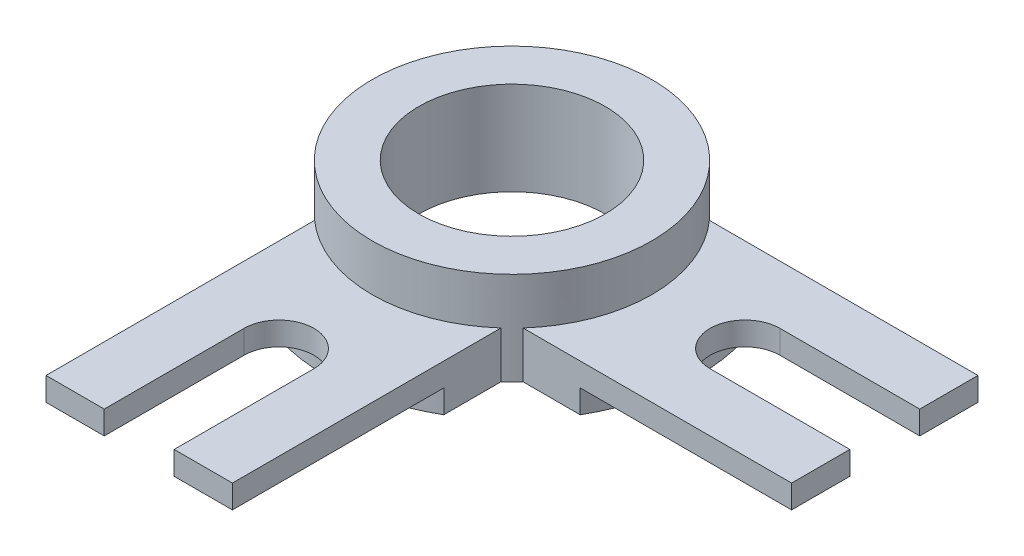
from build123d import *

# Parameters (mm, degrees)
SKETCH_1_R               = 30
EXTRUDE_1_DEPTH          = 20
SKETCH_2_W               = 80
SKETCH_2_H               = 40
EXTRUDE_2_DEPTH          = 10
CUT_EXTRUDE_1_DEPTH      = 87.02325267
SKETCH_4_OUTSIDE_W       = 137.378
SKETCH_4_OUTSIDE_H       = 87.378
SKETCH_4_OUTSIDE_R       = 40
CUT_EXTRUDE_2_DEPTH      = 5
PATTERN_CIRCULAR_1_COUNT = 2
PATTERN_CIRCULAR_1_ANGLE = 90
SKETCH_5_R               = 20
CUT_EXTRUDE_3_DEPTH      = 115.891252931


with BuildPart() as part:
    # Sketch 1 → Extrude 1 (new body)
    with BuildSketch(Plane(origin=(0, 0, 0), x_dir=(1, 0, 0), z_dir=(0, 1, 0))):
        with Locations(Location((0, 0, 0), (0, 0, 270))):
            Circle(SKETCH_1_R)
    extrude(amount=EXTRUDE_1_DEPTH)

    # Sketch 2 → Extrude 2 (add)
    with BuildSketch(Plane.XZ):
        with Locations((40, 0)):
            Rectangle(SKETCH_2_W, SKETCH_2_H)
    extrude_2 = extrude(amount=-EXTRUDE_2_DEPTH)

    # Sketch 3 → Cut-Extrude 1 (cut, through all)
    with BuildSketch(Plane(origin=(0, 10, 0), x_dir=(1, 0, 0), z_dir=(0, 1, 0))):
        with BuildLine():
            Line((50, 7.5), (80, 7.5))
            Line((80, 7.5), (80, -7.5))
            Line((80, -7.5), (50, -7.5))
            ThreePointArc((50, -7.5), (42.5, 0), (50, 7.5))
        make_face()
    cut_extrude_1 = extrude(amount=-CUT_EXTRUDE_1_DEPTH, mode=Mode.SUBTRACT)

    # Sketch 4 outside → Cut-Extrude 2 (cut)
    with BuildSketch(Plane.XZ):
        with Locations((25, 0)):
            Rectangle(SKETCH_4_OUTSIDE_W, SKETCH_4_OUTSIDE_H)
        Circle(SKETCH_4_OUTSIDE_R, mode=Mode.SUBTRACT)
    cut_extrude_2 = extrude(amount=-CUT_EXTRUDE_2_DEPTH, mode=Mode.SUBTRACT)

    # Pattern Circular 1: Extrude 2, Cut-Extrude 1, Cut-Extrude 2 ×2 about axis
    pattern_circular_1_axis = Axis((0, 0, 0), (0, -1, 0))
    add([extrude_2.rotate(pattern_circular_1_axis, i * PATTERN_CIRCULAR_1_ANGLE / (PATTERN_CIRCULAR_1_COUNT - 1)) for i in range(1, PATTERN_CIRCULAR_1_COUNT)])
    add([cut_extrude_1.rotate(pattern_circular_1_axis, i * PATTERN_CIRCULAR_1_ANGLE / (PATTERN_CIRCULAR_1_COUNT - 1)) for i in range(1, PATTERN_CIRCULAR_1_COUNT)], mode=Mode.SUBTRACT)
    add([cut_extrude_2.rotate(pattern_circular_1_axis, i * PATTERN_CIRCULAR_1_ANGLE / (PATTERN_CIRCULAR_1_COUNT - 1)) for i in range(1, PATTERN_CIRCULAR_1_COUNT)], mode=Mode.SUBTRACT)

    # Sketch 5 → Cut-Extrude 3 (cut, through all)
    with BuildSketch(Plane(origin=(0, 20, 0), x_dir=(1, 0, 0), z_dir=(0, 1, 0))):
        with Locations(Location((0, 0, 0), (0, 0, 270))):
            Circle(SKETCH_5_R)
    extrude(amount=-CUT_EXTRUDE_3_DEPTH, mode=Mode.SUBTRACT)


solid = part.part
